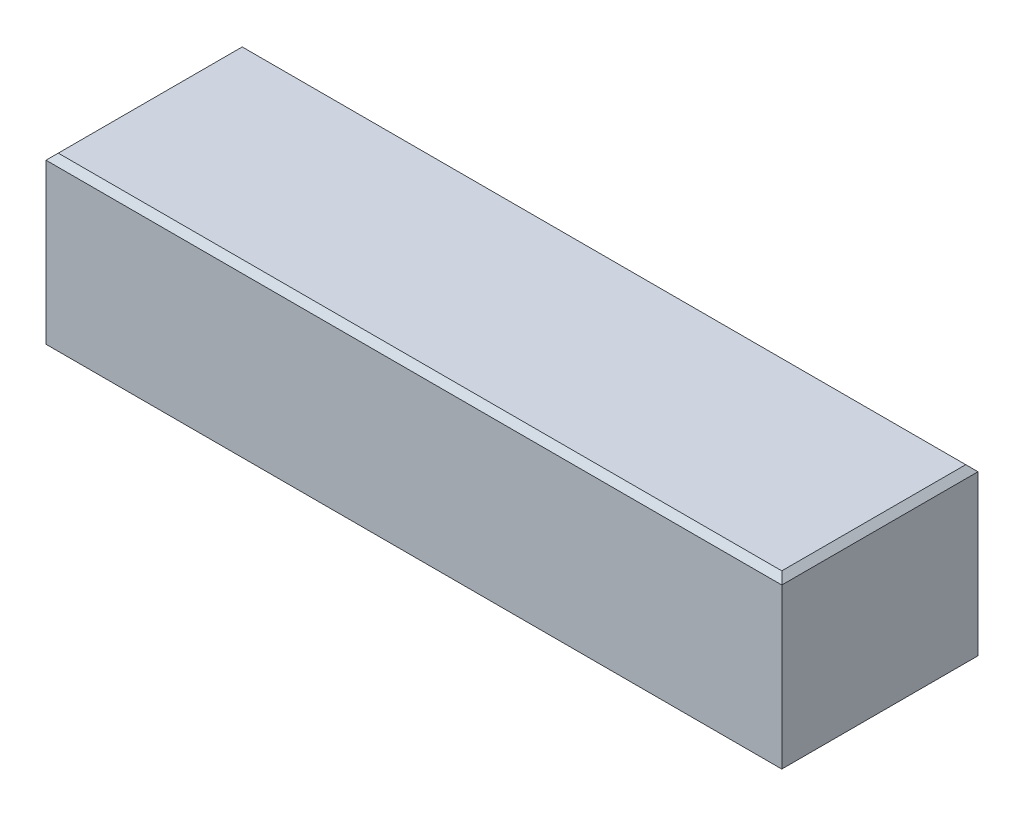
ISO-10303-21;
HEADER;
FILE_DESCRIPTION(('STEP AP214'),'2;1');
FILE_NAME('part.step','',(''),(''),'','','');
FILE_SCHEMA(('AUTOMOTIVE_DESIGN { 1 0 10303 214 1 1 1 1 }'));
ENDSEC;
DATA;
#1=APPLICATION_CONTEXT('core data for automotive mechanical design processes');
#2=APPLICATION_PROTOCOL_DEFINITION('international standard','automotive_design',2000,#1);
#3=PRODUCT_CONTEXT('',#1,'mechanical');
#4=PRODUCT('Part','Part','',(#3));
#5=PRODUCT_RELATED_PRODUCT_CATEGORY('part','',(#4));
#6=PRODUCT_DEFINITION_FORMATION('','',#4);
#7=PRODUCT_DEFINITION_CONTEXT('part definition',#1,'design');
#8=PRODUCT_DEFINITION('design','',#6,#7);
#9=PRODUCT_DEFINITION_SHAPE('','',#8);
#10=(LENGTH_UNIT() NAMED_UNIT(*) SI_UNIT(.MILLI.,.METRE.));
#11=(NAMED_UNIT(*) PLANE_ANGLE_UNIT() SI_UNIT($,.RADIAN.));
#12=(NAMED_UNIT(*) SI_UNIT($,.STERADIAN.) SOLID_ANGLE_UNIT());
#13=UNCERTAINTY_MEASURE_WITH_UNIT(LENGTH_MEASURE(1.E-05),#10,'distance_accuracy_value','');
#14=(GEOMETRIC_REPRESENTATION_CONTEXT(3) GLOBAL_UNCERTAINTY_ASSIGNED_CONTEXT((#13)) GLOBAL_UNIT_ASSIGNED_CONTEXT((#10,
#11,#12)) REPRESENTATION_CONTEXT('',''));
#15=CARTESIAN_POINT('',(0.,0.,0.));
#16=DIRECTION('',(0.,0.,1.));
#17=DIRECTION('',(1.,0.,0.));
#18=AXIS2_PLACEMENT_3D('',#15,#16,#17);
#19=CARTESIAN_POINT('',(0.,7.,4.));
#20=DIRECTION('',(1.,0.,0.));
#21=DIRECTION('',(0.,0.,-1.));
#22=AXIS2_PLACEMENT_3D('',#19,#20,#21);
#23=PLANE('',#22);
#24=DIRECTION('',(0.,-1.,0.));
#25=VECTOR('',#24,1.);
#26=CARTESIAN_POINT('',(0.,7.,4.));
#27=LINE('',#26,#25);
#28=CARTESIAN_POINT('',(0.,6.75,4.));
#29=VERTEX_POINT('',#28);
#30=CARTESIAN_POINT('',(0.,0.250000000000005,4.));
#31=VERTEX_POINT('',#30);
#32=EDGE_CURVE('E114',#29,#31,#27,.T.);
#33=ORIENTED_EDGE('',*,*,#32,.F.);
#34=DIRECTION('',(0.,0.,-1.));
#35=VECTOR('',#34,1.);
#36=CARTESIAN_POINT('',(0.,6.75,-4.));
#37=LINE('',#36,#35);
#38=CARTESIAN_POINT('',(0.,6.75,-4.));
#39=VERTEX_POINT('',#38);
#40=EDGE_CURVE('E138',#29,#39,#37,.T.);
#41=ORIENTED_EDGE('',*,*,#40,.T.);
#42=DIRECTION('',(0.,-1.,0.));
#43=VECTOR('',#42,1.);
#44=CARTESIAN_POINT('',(0.,7.,-4.));
#45=LINE('',#44,#43);
#46=CARTESIAN_POINT('',(0.,0.250000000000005,-4.));
#47=VERTEX_POINT('',#46);
#48=EDGE_CURVE('E165',#39,#47,#45,.T.);
#49=ORIENTED_EDGE('',*,*,#48,.T.);
#50=DIRECTION('',(0.,0.,1.));
#51=VECTOR('',#50,1.);
#52=CARTESIAN_POINT('',(0.,0.250000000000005,4.));
#53=LINE('',#52,#51);
#54=EDGE_CURVE('E136',#47,#31,#53,.T.);
#55=ORIENTED_EDGE('',*,*,#54,.T.);
#56=EDGE_LOOP('',(#33,#41,#49,#55));
#57=FACE_BOUND('',#56,.T.);
#58=ADVANCED_FACE('F31',(#57),#23,.F.);
#59=CARTESIAN_POINT('',(30.,7.,4.));
#60=DIRECTION('',(0.,0.,-1.));
#61=DIRECTION('',(-1.,0.,0.));
#62=AXIS2_PLACEMENT_3D('',#59,#60,#61);
#63=PLANE('',#62);
#64=DIRECTION('',(0.,-1.,0.));
#65=VECTOR('',#64,1.);
#66=CARTESIAN_POINT('',(30.,7.,4.));
#67=LINE('',#66,#65);
#68=CARTESIAN_POINT('',(30.,6.75,4.));
#69=VERTEX_POINT('',#68);
#70=CARTESIAN_POINT('',(30.,0.250000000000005,4.));
#71=VERTEX_POINT('',#70);
#72=EDGE_CURVE('E171',#69,#71,#67,.T.);
#73=ORIENTED_EDGE('',*,*,#72,.F.);
#74=DIRECTION('',(-1.,0.,0.));
#75=VECTOR('',#74,1.);
#76=CARTESIAN_POINT('',(0.,6.75,4.));
#77=LINE('',#76,#75);
#78=EDGE_CURVE('E134',#69,#29,#77,.T.);
#79=ORIENTED_EDGE('',*,*,#78,.T.);
#80=ORIENTED_EDGE('',*,*,#32,.T.);
#81=DIRECTION('',(1.,0.,0.));
#82=VECTOR('',#81,1.);
#83=CARTESIAN_POINT('',(30.,0.250000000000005,4.));
#84=LINE('',#83,#82);
#85=EDGE_CURVE('E131',#31,#71,#84,.T.);
#86=ORIENTED_EDGE('',*,*,#85,.T.);
#87=EDGE_LOOP('',(#73,#79,#80,#86));
#88=FACE_BOUND('',#87,.T.);
#89=ADVANCED_FACE('F196',(#88),#63,.F.);
#90=CARTESIAN_POINT('',(30.,7.,4.));
#91=DIRECTION('',(-1.,0.,0.));
#92=DIRECTION('',(0.,0.,1.));
#93=AXIS2_PLACEMENT_3D('',#90,#91,#92);
#94=PLANE('',#93);
#95=DIRECTION('',(0.,-1.,0.));
#96=VECTOR('',#95,1.);
#97=CARTESIAN_POINT('',(30.,7.,-4.));
#98=LINE('',#97,#96);
#99=CARTESIAN_POINT('',(30.,6.75,-4.));
#100=VERTEX_POINT('',#99);
#101=CARTESIAN_POINT('',(30.,0.250000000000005,-4.));
#102=VERTEX_POINT('',#101);
#103=EDGE_CURVE('E168',#100,#102,#98,.T.);
#104=ORIENTED_EDGE('',*,*,#103,.F.);
#105=DIRECTION('',(0.,0.,1.));
#106=VECTOR('',#105,1.);
#107=CARTESIAN_POINT('',(30.,6.75,4.));
#108=LINE('',#107,#106);
#109=EDGE_CURVE('E129',#100,#69,#108,.T.);
#110=ORIENTED_EDGE('',*,*,#109,.T.);
#111=ORIENTED_EDGE('',*,*,#72,.T.);
#112=DIRECTION('',(0.,0.,-1.));
#113=VECTOR('',#112,1.);
#114=CARTESIAN_POINT('',(30.,0.250000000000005,4.));
#115=LINE('',#114,#113);
#116=EDGE_CURVE('E127',#71,#102,#115,.T.);
#117=ORIENTED_EDGE('',*,*,#116,.T.);
#118=EDGE_LOOP('',(#104,#110,#111,#117));
#119=FACE_BOUND('',#118,.T.);
#120=ADVANCED_FACE('F188',(#119),#94,.F.);
#121=CARTESIAN_POINT('',(30.,7.,-4.));
#122=DIRECTION('',(0.,0.,1.));
#123=DIRECTION('',(1.,0.,0.));
#124=AXIS2_PLACEMENT_3D('',#121,#122,#123);
#125=PLANE('',#124);
#126=ORIENTED_EDGE('',*,*,#48,.F.);
#127=DIRECTION('',(1.,0.,0.));
#128=VECTOR('',#127,1.);
#129=CARTESIAN_POINT('',(30.,6.75,-4.));
#130=LINE('',#129,#128);
#131=EDGE_CURVE('E100',#39,#100,#130,.T.);
#132=ORIENTED_EDGE('',*,*,#131,.T.);
#133=ORIENTED_EDGE('',*,*,#103,.T.);
#134=DIRECTION('',(-1.,0.,0.));
#135=VECTOR('',#134,1.);
#136=CARTESIAN_POINT('',(30.,0.250000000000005,-4.));
#137=LINE('',#136,#135);
#138=EDGE_CURVE('E120',#102,#47,#137,.T.);
#139=ORIENTED_EDGE('',*,*,#138,.T.);
#140=EDGE_LOOP('',(#126,#132,#133,#139));
#141=FACE_BOUND('',#140,.T.);
#142=ADVANCED_FACE('F187',(#141),#125,.F.);
#143=CARTESIAN_POINT('',(0.,7.,-4.));
#144=DIRECTION('',(0.,1.,0.));
#145=DIRECTION('',(0.,0.,1.));
#146=AXIS2_PLACEMENT_3D('',#143,#144,#145);
#147=PLANE('',#146);
#148=DIRECTION('',(0.,0.,-1.));
#149=VECTOR('',#148,1.);
#150=CARTESIAN_POINT('',(29.75,7.,-4.));
#151=LINE('',#150,#149);
#152=CARTESIAN_POINT('',(29.75,7.,3.75));
#153=VERTEX_POINT('',#152);
#154=CARTESIAN_POINT('',(29.75,7.,-3.75));
#155=VERTEX_POINT('',#154);
#156=EDGE_CURVE('E118',#153,#155,#151,.T.);
#157=ORIENTED_EDGE('',*,*,#156,.T.);
#158=DIRECTION('',(-1.,0.,0.));
#159=VECTOR('',#158,1.);
#160=CARTESIAN_POINT('',(0.,7.,-3.74999999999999));
#161=LINE('',#160,#159);
#162=CARTESIAN_POINT('',(0.250000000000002,7.,-3.74999999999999));
#163=VERTEX_POINT('',#162);
#164=EDGE_CURVE('E98',#155,#163,#161,.T.);
#165=ORIENTED_EDGE('',*,*,#164,.T.);
#166=DIRECTION('',(0.,0.,1.));
#167=VECTOR('',#166,1.);
#168=CARTESIAN_POINT('',(0.250000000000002,7.,4.));
#169=LINE('',#168,#167);
#170=CARTESIAN_POINT('',(0.250000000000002,7.,3.74999999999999));
#171=VERTEX_POINT('',#170);
#172=EDGE_CURVE('E107',#163,#171,#169,.T.);
#173=ORIENTED_EDGE('',*,*,#172,.T.);
#174=DIRECTION('',(1.,0.,0.));
#175=VECTOR('',#174,1.);
#176=CARTESIAN_POINT('',(30.,7.,3.75));
#177=LINE('',#176,#175);
#178=EDGE_CURVE('E113',#171,#153,#177,.T.);
#179=ORIENTED_EDGE('',*,*,#178,.T.);
#180=EDGE_LOOP('',(#157,#165,#173,#179));
#181=FACE_BOUND('',#180,.T.);
#182=ADVANCED_FACE('F116',(#181),#147,.T.);
#183=CARTESIAN_POINT('',(0.,0.,-4.));
#184=DIRECTION('',(0.,1.,0.));
#185=DIRECTION('',(0.,0.,1.));
#186=AXIS2_PLACEMENT_3D('',#183,#184,#185);
#187=PLANE('',#186);
#188=DIRECTION('',(0.,0.,1.));
#189=VECTOR('',#188,1.);
#190=CARTESIAN_POINT('',(29.75,0.,-4.));
#191=LINE('',#190,#189);
#192=CARTESIAN_POINT('',(29.75,0.,-3.75));
#193=VERTEX_POINT('',#192);
#194=CARTESIAN_POINT('',(29.75,0.,3.75));
#195=VERTEX_POINT('',#194);
#196=EDGE_CURVE('E38',#193,#195,#191,.T.);
#197=ORIENTED_EDGE('',*,*,#196,.T.);
#198=DIRECTION('',(-1.,0.,0.));
#199=VECTOR('',#198,1.);
#200=CARTESIAN_POINT('',(0.,0.,3.75));
#201=LINE('',#200,#199);
#202=CARTESIAN_POINT('',(0.250000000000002,0.,3.75));
#203=VERTEX_POINT('',#202);
#204=EDGE_CURVE('E11',#195,#203,#201,.T.);
#205=ORIENTED_EDGE('',*,*,#204,.T.);
#206=DIRECTION('',(0.,0.,-1.));
#207=VECTOR('',#206,1.);
#208=CARTESIAN_POINT('',(0.250000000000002,0.,-4.));
#209=LINE('',#208,#207);
#210=CARTESIAN_POINT('',(0.250000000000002,0.,-3.75));
#211=VERTEX_POINT('',#210);
#212=EDGE_CURVE('E140',#203,#211,#209,.T.);
#213=ORIENTED_EDGE('',*,*,#212,.T.);
#214=DIRECTION('',(1.,0.,0.));
#215=VECTOR('',#214,1.);
#216=CARTESIAN_POINT('',(0.,0.,-3.75));
#217=LINE('',#216,#215);
#218=EDGE_CURVE('E48',#211,#193,#217,.T.);
#219=ORIENTED_EDGE('',*,*,#218,.T.);
#220=EDGE_LOOP('',(#197,#205,#213,#219));
#221=FACE_BOUND('',#220,.T.);
#222=ADVANCED_FACE('F143',(#221),#187,.F.);
#223=CARTESIAN_POINT('',(0.,7.,3.74999999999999));
#224=DIRECTION('',(0.,0.707106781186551,0.707106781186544));
#225=DIRECTION('',(0.,-0.707106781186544,0.707106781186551));
#226=AXIS2_PLACEMENT_3D('',#223,#224,#225);
#227=PLANE('',#226);
#228=DIRECTION('',(0.57735026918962,0.577350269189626,-0.577350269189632));
#229=VECTOR('',#228,1.);
#230=CARTESIAN_POINT('',(2.83333333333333,9.58333333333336,1.16666666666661));
#231=LINE('',#230,#229);
#232=EDGE_CURVE('E110',#29,#171,#231,.T.);
#233=ORIENTED_EDGE('',*,*,#232,.F.);
#234=ORIENTED_EDGE('',*,*,#78,.F.);
#235=DIRECTION('',(-0.577350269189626,0.577350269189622,-0.577350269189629));
#236=VECTOR('',#235,1.);
#237=CARTESIAN_POINT('',(19.8333333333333,16.9166666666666,-6.16666666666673));
#238=LINE('',#237,#236);
#239=EDGE_CURVE('E162',#153,#69,#238,.F.);
#240=ORIENTED_EDGE('',*,*,#239,.F.);
#241=ORIENTED_EDGE('',*,*,#178,.F.);
#242=EDGE_LOOP('',(#233,#234,#240,#241));
#243=FACE_BOUND('',#242,.T.);
#244=ADVANCED_FACE('F178',(#243),#227,.T.);
#245=CARTESIAN_POINT('',(29.75,7.,-4.));
#246=DIRECTION('',(0.707106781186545,0.70710678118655,0.));
#247=DIRECTION('',(-0.70710678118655,0.707106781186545,0.));
#248=AXIS2_PLACEMENT_3D('',#245,#246,#247);
#249=PLANE('',#248);
#250=ORIENTED_EDGE('',*,*,#239,.T.);
#251=ORIENTED_EDGE('',*,*,#109,.F.);
#252=DIRECTION('',(-0.577350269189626,0.577350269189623,0.577350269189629));
#253=VECTOR('',#252,1.);
#254=CARTESIAN_POINT('',(29.8333333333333,6.91666666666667,-3.83333333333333));
#255=LINE('',#254,#253);
#256=EDGE_CURVE('E103',#155,#100,#255,.F.);
#257=ORIENTED_EDGE('',*,*,#256,.F.);
#258=ORIENTED_EDGE('',*,*,#156,.F.);
#259=EDGE_LOOP('',(#250,#251,#257,#258));
#260=FACE_BOUND('',#259,.T.);
#261=ADVANCED_FACE('F181',(#260),#249,.T.);
#262=CARTESIAN_POINT('',(0.250000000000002,7.,-4.));
#263=DIRECTION('',(-0.707106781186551,0.707106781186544,0.));
#264=DIRECTION('',(-0.707106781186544,-0.707106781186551,0.));
#265=AXIS2_PLACEMENT_3D('',#262,#263,#264);
#266=PLANE('',#265);
#267=ORIENTED_EDGE('',*,*,#232,.T.);
#268=ORIENTED_EDGE('',*,*,#172,.F.);
#269=DIRECTION('',(-0.57735026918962,-0.577350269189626,-0.577350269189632));
#270=VECTOR('',#269,1.);
#271=CARTESIAN_POINT('',(0.166666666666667,6.91666666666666,-3.83333333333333));
#272=LINE('',#271,#270);
#273=EDGE_CURVE('E94',#39,#163,#272,.F.);
#274=ORIENTED_EDGE('',*,*,#273,.F.);
#275=ORIENTED_EDGE('',*,*,#40,.F.);
#276=EDGE_LOOP('',(#267,#268,#274,#275));
#277=FACE_BOUND('',#276,.T.);
#278=ADVANCED_FACE('F108',(#277),#266,.T.);
#279=CARTESIAN_POINT('',(0.,7.,-3.74999999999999));
#280=DIRECTION('',(0.,0.707106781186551,-0.707106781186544));
#281=DIRECTION('',(0.,0.707106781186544,0.707106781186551));
#282=AXIS2_PLACEMENT_3D('',#279,#280,#281);
#283=PLANE('',#282);
#284=ORIENTED_EDGE('',*,*,#256,.T.);
#285=ORIENTED_EDGE('',*,*,#131,.F.);
#286=ORIENTED_EDGE('',*,*,#273,.T.);
#287=ORIENTED_EDGE('',*,*,#164,.F.);
#288=EDGE_LOOP('',(#284,#285,#286,#287));
#289=FACE_BOUND('',#288,.T.);
#290=ADVANCED_FACE('F96',(#289),#283,.T.);
#291=CARTESIAN_POINT('',(30.,0.250000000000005,-4.));
#292=DIRECTION('',(0.,0.707106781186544,0.707106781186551));
#293=DIRECTION('',(0.,-0.707106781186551,0.707106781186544));
#294=AXIS2_PLACEMENT_3D('',#291,#292,#293);
#295=PLANE('',#294);
#296=DIRECTION('',(-0.577350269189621,-0.577350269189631,0.577350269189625));
#297=VECTOR('',#296,1.);
#298=CARTESIAN_POINT('',(30.,0.250000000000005,-4.));
#299=LINE('',#298,#297);
#300=EDGE_CURVE('E153',#193,#102,#299,.F.);
#301=ORIENTED_EDGE('',*,*,#300,.F.);
#302=ORIENTED_EDGE('',*,*,#218,.F.);
#303=DIRECTION('',(0.577350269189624,-0.57735026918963,0.577350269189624));
#304=VECTOR('',#303,1.);
#305=CARTESIAN_POINT('',(2.66666666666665,-2.41666666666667,-1.33333333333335));
#306=LINE('',#305,#304);
#307=EDGE_CURVE('E104',#47,#211,#306,.T.);
#308=ORIENTED_EDGE('',*,*,#307,.F.);
#309=ORIENTED_EDGE('',*,*,#138,.F.);
#310=EDGE_LOOP('',(#301,#302,#308,#309));
#311=FACE_BOUND('',#310,.T.);
#312=ADVANCED_FACE('F149',(#311),#295,.F.);
#313=CARTESIAN_POINT('',(0.,0.250000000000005,4.));
#314=DIRECTION('',(0.707106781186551,0.707106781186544,0.));
#315=DIRECTION('',(-0.707106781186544,0.707106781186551,0.));
#316=AXIS2_PLACEMENT_3D('',#313,#314,#315);
#317=PLANE('',#316);
#318=ORIENTED_EDGE('',*,*,#307,.T.);
#319=ORIENTED_EDGE('',*,*,#212,.F.);
#320=DIRECTION('',(-0.577350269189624,0.57735026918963,0.577350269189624));
#321=VECTOR('',#320,1.);
#322=CARTESIAN_POINT('',(0.,0.250000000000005,4.));
#323=LINE('',#322,#321);
#324=EDGE_CURVE('E156',#31,#203,#323,.F.);
#325=ORIENTED_EDGE('',*,*,#324,.F.);
#326=ORIENTED_EDGE('',*,*,#54,.F.);
#327=EDGE_LOOP('',(#318,#319,#325,#326));
#328=FACE_BOUND('',#327,.T.);
#329=ADVANCED_FACE('F154',(#328),#317,.F.);
#330=CARTESIAN_POINT('',(30.,0.250000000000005,4.));
#331=DIRECTION('',(-0.707106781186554,0.707106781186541,0.));
#332=DIRECTION('',(-0.707106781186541,-0.707106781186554,0.));
#333=AXIS2_PLACEMENT_3D('',#330,#331,#332);
#334=PLANE('',#333);
#335=ORIENTED_EDGE('',*,*,#300,.T.);
#336=ORIENTED_EDGE('',*,*,#116,.F.);
#337=DIRECTION('',(-0.577350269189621,-0.577350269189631,-0.577350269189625));
#338=VECTOR('',#337,1.);
#339=CARTESIAN_POINT('',(30.,0.250000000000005,4.));
#340=LINE('',#339,#338);
#341=EDGE_CURVE('E193',#195,#71,#340,.F.);
#342=ORIENTED_EDGE('',*,*,#341,.F.);
#343=ORIENTED_EDGE('',*,*,#196,.F.);
#344=EDGE_LOOP('',(#335,#336,#342,#343));
#345=FACE_BOUND('',#344,.T.);
#346=ADVANCED_FACE('F192',(#345),#334,.F.);
#347=CARTESIAN_POINT('',(30.,0.250000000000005,4.));
#348=DIRECTION('',(0.,0.707106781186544,-0.707106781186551));
#349=DIRECTION('',(0.,0.707106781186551,0.707106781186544));
#350=AXIS2_PLACEMENT_3D('',#347,#348,#349);
#351=PLANE('',#350);
#352=ORIENTED_EDGE('',*,*,#324,.T.);
#353=ORIENTED_EDGE('',*,*,#204,.F.);
#354=ORIENTED_EDGE('',*,*,#341,.T.);
#355=ORIENTED_EDGE('',*,*,#85,.F.);
#356=EDGE_LOOP('',(#352,#353,#354,#355));
#357=FACE_BOUND('',#356,.T.);
#358=ADVANCED_FACE('F199',(#357),#351,.F.);
#359=CLOSED_SHELL('',(#58,#89,#120,#142,#182,#222,#244,#261,#278,#290,#312,#329,#346,#358));
#360=MANIFOLD_SOLID_BREP('B2',#359);
#361=ADVANCED_BREP_SHAPE_REPRESENTATION('',(#18,#360),#14);
#362=SHAPE_DEFINITION_REPRESENTATION(#9,#361);
ENDSEC;
END-ISO-10303-21;
